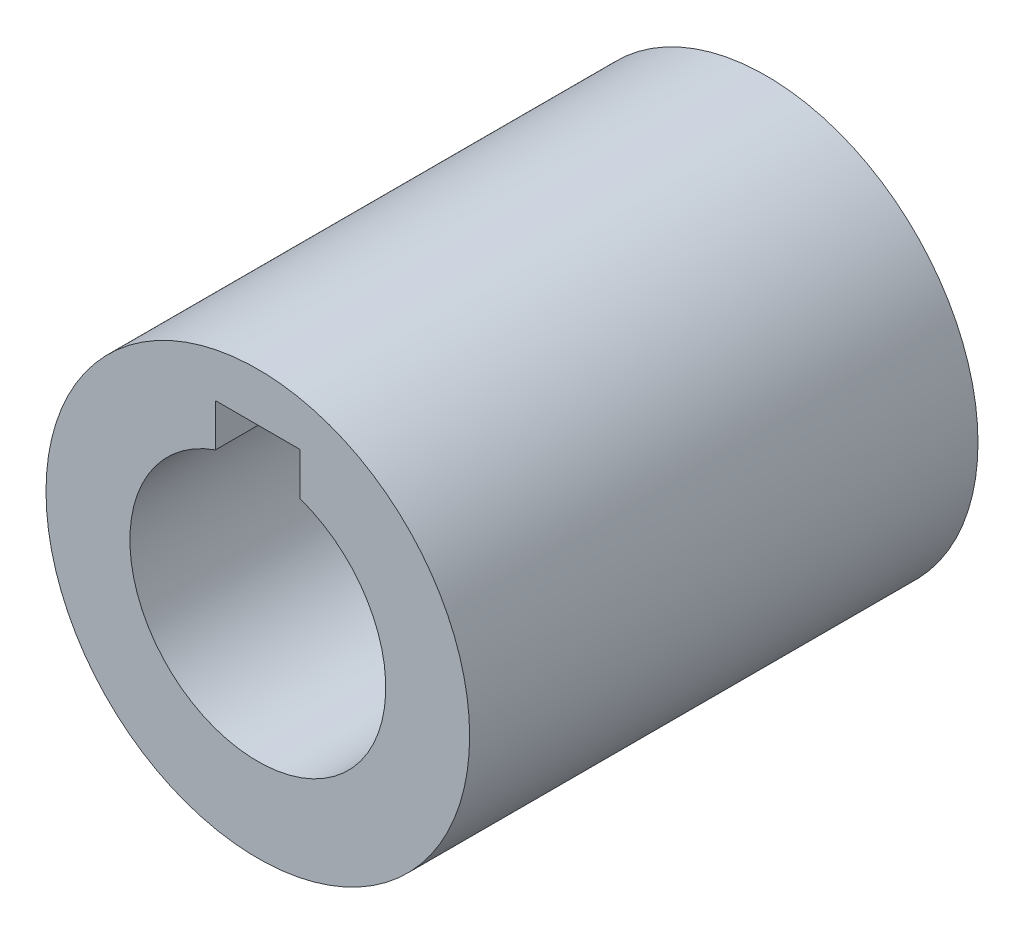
from build123d import *

# Parameters (mm, degrees)
SKETCH1_R          = 15.875
SKETCH1_R_2        = 9.5885
EXTRUDE1_DEPTH     = 19.05
SKETCH2_W          = 6.35
SKETCH2_H          = 3.2004
CUT_EXTRUDE1_DEPTH = 45.22263278


with BuildPart() as part:
    # Sketch1 → Extrude1 (new, symmetric)
    with BuildSketch(Plane.XY):
        with Locations(Location((0, 0, 0), (0, 0, 180))):
            Circle(SKETCH1_R)
        with Locations(Location((0, 0, 0), (0, 0, 180))):
            Circle(SKETCH1_R_2, mode=Mode.SUBTRACT)
    extrude(amount=EXTRUDE1_DEPTH, both=True)

    # Sketch2 → Cut-Extrude1 (cut, through all)
    with BuildSketch(Plane.XY.offset(19.05)):
        with Locations((0, 10.647780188)):
            Rectangle(SKETCH2_W, SKETCH2_H)
    extrude(amount=-CUT_EXTRUDE1_DEPTH, mode=Mode.SUBTRACT)


solid = part.part
